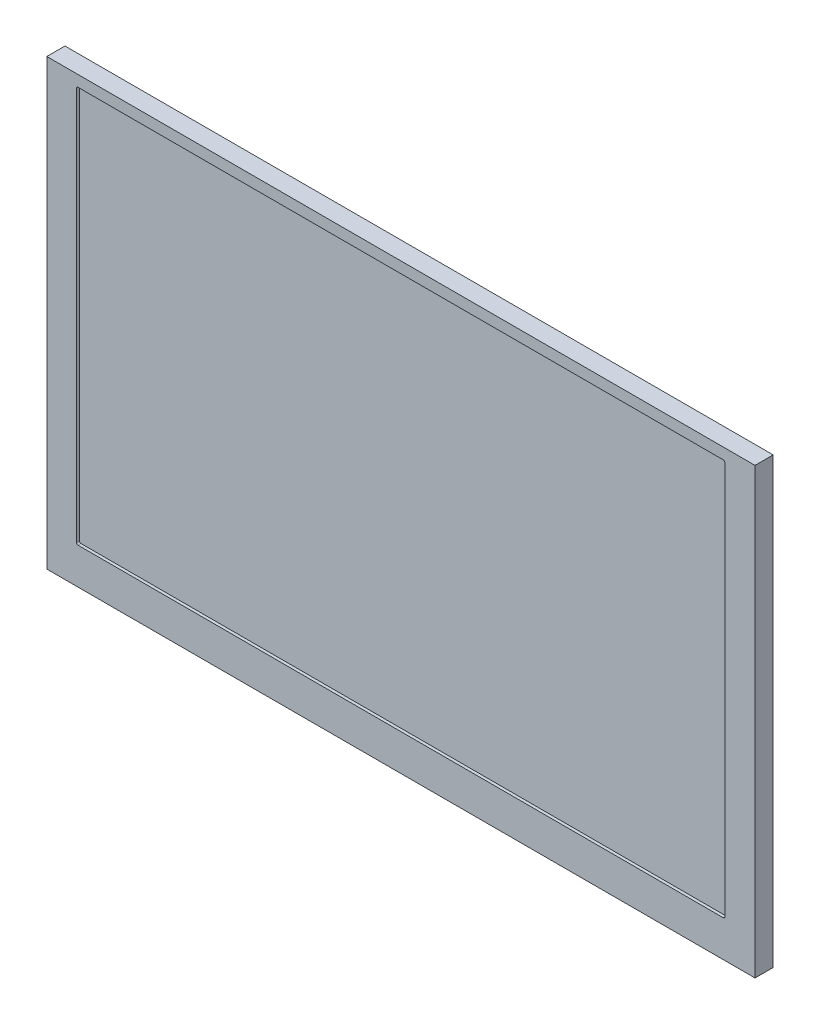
from build123d import *

# Parameters (mm, degrees)
SKETCH2_W           = 121
SKETCH2_H           = 75.85
BOSS_EXTRUDE1_DEPTH = 3.1
CUT_EXTRUDE1_DEPTH  = 0.5


with BuildPart() as part:
    # Sketch2 → Boss-Extrude1 (new body)
    with BuildSketch(Plane.XY):
        Rectangle(SKETCH2_W, SKETCH2_H)
    extrude(amount=BOSS_EXTRUDE1_DEPTH)

    # Sketch3 → Cut-Extrude1 (cut)
    with BuildSketch(Plane.XY.offset(3.1)):
        with BuildLine():
            Line((55.35, -31.42), (55.35, 35.73))
            ThreePointArc((55.35, 35.73), (55.262132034, 35.942132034), (55.05, 36.03))
            Line((55.05, 36.03), (-55.15, 36.03))
            ThreePointArc((-55.15, 36.03), (-55.362132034, 35.942132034), (-55.45, 35.73))
            Line((-55.45, 35.73), (-55.45, -31.42))
            ThreePointArc((-55.45, -31.42), (-55.362132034, -31.632132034), (-55.15, -31.72))
            Line((-55.15, -31.72), (55.05, -31.72))
            ThreePointArc((55.05, -31.72), (55.262132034, -31.632132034), (55.35, -31.42))
        make_face()
    extrude(amount=-CUT_EXTRUDE1_DEPTH, mode=Mode.SUBTRACT)


solid = part.part
